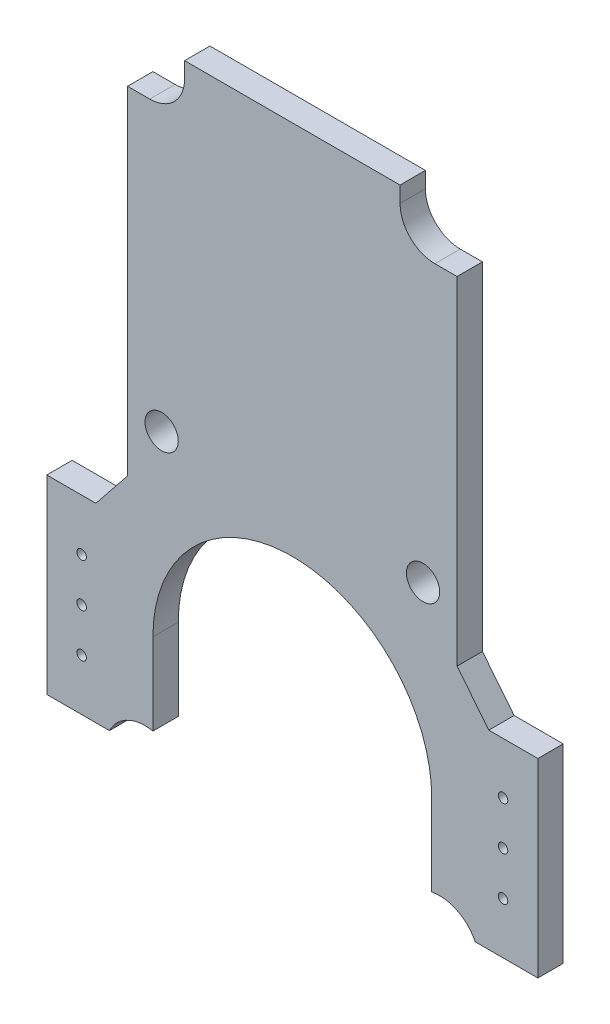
ISO-10303-21;
HEADER;
FILE_DESCRIPTION(('STEP AP214'),'2;1');
FILE_NAME('part.step','',(''),(''),'','','');
FILE_SCHEMA(('AUTOMOTIVE_DESIGN { 1 0 10303 214 1 1 1 1 }'));
ENDSEC;
DATA;
#1=APPLICATION_CONTEXT('core data for automotive mechanical design processes');
#2=APPLICATION_PROTOCOL_DEFINITION('international standard','automotive_design',2000,#1);
#3=PRODUCT_CONTEXT('',#1,'mechanical');
#4=PRODUCT('Part','Part','',(#3));
#5=PRODUCT_RELATED_PRODUCT_CATEGORY('part','',(#4));
#6=PRODUCT_DEFINITION_FORMATION('','',#4);
#7=PRODUCT_DEFINITION_CONTEXT('part definition',#1,'design');
#8=PRODUCT_DEFINITION('design','',#6,#7);
#9=PRODUCT_DEFINITION_SHAPE('','',#8);
#10=(LENGTH_UNIT() NAMED_UNIT(*) SI_UNIT(.MILLI.,.METRE.));
#11=(NAMED_UNIT(*) PLANE_ANGLE_UNIT() SI_UNIT($,.RADIAN.));
#12=(NAMED_UNIT(*) SI_UNIT($,.STERADIAN.) SOLID_ANGLE_UNIT());
#13=UNCERTAINTY_MEASURE_WITH_UNIT(LENGTH_MEASURE(1.E-05),#10,'distance_accuracy_value','');
#14=(GEOMETRIC_REPRESENTATION_CONTEXT(3) GLOBAL_UNCERTAINTY_ASSIGNED_CONTEXT((#13)) GLOBAL_UNIT_ASSIGNED_CONTEXT((#10,
#11,#12)) REPRESENTATION_CONTEXT('',''));
#15=CARTESIAN_POINT('',(0.,0.,0.));
#16=DIRECTION('',(0.,0.,1.));
#17=DIRECTION('',(1.,0.,0.));
#18=AXIS2_PLACEMENT_3D('',#15,#16,#17);
#19=CARTESIAN_POINT('',(13.3,-23.,0.));
#20=DIRECTION('',(0.,0.,1.));
#21=DIRECTION('',(1.,0.,0.));
#22=AXIS2_PLACEMENT_3D('',#19,#20,#21);
#23=CYLINDRICAL_SURFACE('',#22,0.299999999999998);
#24=CARTESIAN_POINT('',(13.3,-23.,1.6));
#25=DIRECTION('',(0.,0.,1.));
#26=DIRECTION('',(1.,0.,0.));
#27=AXIS2_PLACEMENT_3D('',#24,#25,#26);
#28=CIRCLE('',#27,0.299999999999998);
#29=CARTESIAN_POINT('',(13.6,-23.,1.6));
#30=VERTEX_POINT('',#29);
#31=EDGE_CURVE('E314',#30,#30,#28,.F.);
#32=ORIENTED_EDGE('',*,*,#31,.F.);
#33=EDGE_LOOP('',(#32));
#34=FACE_BOUND('',#33,.T.);
#35=CARTESIAN_POINT('',(13.3,-23.,0.));
#36=DIRECTION('',(0.,0.,1.));
#37=DIRECTION('',(1.,0.,0.));
#38=AXIS2_PLACEMENT_3D('',#35,#36,#37);
#39=CIRCLE('',#38,0.299999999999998);
#40=CARTESIAN_POINT('',(13.6,-23.,0.));
#41=VERTEX_POINT('',#40);
#42=EDGE_CURVE('E257',#41,#41,#39,.F.);
#43=ORIENTED_EDGE('',*,*,#42,.T.);
#44=EDGE_LOOP('',(#43));
#45=FACE_BOUND('',#44,.T.);
#46=ADVANCED_FACE('F17',(#34,#45),#23,.F.);
#47=CARTESIAN_POINT('',(13.3,-25.75,0.));
#48=DIRECTION('',(0.,0.,1.));
#49=DIRECTION('',(1.,0.,0.));
#50=AXIS2_PLACEMENT_3D('',#47,#48,#49);
#51=CYLINDRICAL_SURFACE('',#50,0.299999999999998);
#52=CARTESIAN_POINT('',(13.3,-25.75,1.6));
#53=DIRECTION('',(0.,0.,1.));
#54=DIRECTION('',(1.,0.,0.));
#55=AXIS2_PLACEMENT_3D('',#52,#53,#54);
#56=CIRCLE('',#55,0.299999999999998);
#57=CARTESIAN_POINT('',(13.6,-25.75,1.6));
#58=VERTEX_POINT('',#57);
#59=EDGE_CURVE('E311',#58,#58,#56,.F.);
#60=ORIENTED_EDGE('',*,*,#59,.F.);
#61=EDGE_LOOP('',(#60));
#62=FACE_BOUND('',#61,.T.);
#63=CARTESIAN_POINT('',(13.3,-25.75,0.));
#64=DIRECTION('',(0.,0.,1.));
#65=DIRECTION('',(1.,0.,0.));
#66=AXIS2_PLACEMENT_3D('',#63,#64,#65);
#67=CIRCLE('',#66,0.299999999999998);
#68=CARTESIAN_POINT('',(13.6,-25.75,0.));
#69=VERTEX_POINT('',#68);
#70=EDGE_CURVE('E254',#69,#69,#67,.F.);
#71=ORIENTED_EDGE('',*,*,#70,.T.);
#72=EDGE_LOOP('',(#71));
#73=FACE_BOUND('',#72,.T.);
#74=ADVANCED_FACE('F633',(#62,#73),#51,.F.);
#75=CARTESIAN_POINT('',(-13.3,-25.75,0.));
#76=DIRECTION('',(0.,0.,1.));
#77=DIRECTION('',(1.,0.,0.));
#78=AXIS2_PLACEMENT_3D('',#75,#76,#77);
#79=CYLINDRICAL_SURFACE('',#78,0.3);
#80=CARTESIAN_POINT('',(-13.3,-25.75,1.6));
#81=DIRECTION('',(0.,0.,1.));
#82=DIRECTION('',(1.,0.,0.));
#83=AXIS2_PLACEMENT_3D('',#80,#81,#82);
#84=CIRCLE('',#83,0.3);
#85=CARTESIAN_POINT('',(-13.,-25.75,1.6));
#86=VERTEX_POINT('',#85);
#87=EDGE_CURVE('E308',#86,#86,#84,.F.);
#88=ORIENTED_EDGE('',*,*,#87,.F.);
#89=EDGE_LOOP('',(#88));
#90=FACE_BOUND('',#89,.T.);
#91=CARTESIAN_POINT('',(-13.3,-25.75,0.));
#92=DIRECTION('',(0.,0.,1.));
#93=DIRECTION('',(1.,0.,0.));
#94=AXIS2_PLACEMENT_3D('',#91,#92,#93);
#95=CIRCLE('',#94,0.3);
#96=CARTESIAN_POINT('',(-13.,-25.75,0.));
#97=VERTEX_POINT('',#96);
#98=EDGE_CURVE('E251',#97,#97,#95,.F.);
#99=ORIENTED_EDGE('',*,*,#98,.T.);
#100=EDGE_LOOP('',(#99));
#101=FACE_BOUND('',#100,.T.);
#102=ADVANCED_FACE('F639',(#90,#101),#79,.F.);
#103=CARTESIAN_POINT('',(-13.3,-23.,0.));
#104=DIRECTION('',(0.,0.,1.));
#105=DIRECTION('',(1.,0.,0.));
#106=AXIS2_PLACEMENT_3D('',#103,#104,#105);
#107=CYLINDRICAL_SURFACE('',#106,0.3);
#108=CARTESIAN_POINT('',(-13.3,-23.,1.6));
#109=DIRECTION('',(0.,0.,1.));
#110=DIRECTION('',(1.,0.,0.));
#111=AXIS2_PLACEMENT_3D('',#108,#109,#110);
#112=CIRCLE('',#111,0.3);
#113=CARTESIAN_POINT('',(-13.,-23.,1.6));
#114=VERTEX_POINT('',#113);
#115=EDGE_CURVE('E305',#114,#114,#112,.F.);
#116=ORIENTED_EDGE('',*,*,#115,.F.);
#117=EDGE_LOOP('',(#116));
#118=FACE_BOUND('',#117,.T.);
#119=CARTESIAN_POINT('',(-13.3,-23.,0.));
#120=DIRECTION('',(0.,0.,1.));
#121=DIRECTION('',(1.,0.,0.));
#122=AXIS2_PLACEMENT_3D('',#119,#120,#121);
#123=CIRCLE('',#122,0.3);
#124=CARTESIAN_POINT('',(-13.,-23.,0.));
#125=VERTEX_POINT('',#124);
#126=EDGE_CURVE('E248',#125,#125,#123,.F.);
#127=ORIENTED_EDGE('',*,*,#126,.T.);
#128=EDGE_LOOP('',(#127));
#129=FACE_BOUND('',#128,.T.);
#130=ADVANCED_FACE('F644',(#118,#129),#107,.F.);
#131=CARTESIAN_POINT('',(-13.3,-20.25,0.));
#132=DIRECTION('',(0.,0.,1.));
#133=DIRECTION('',(1.,0.,0.));
#134=AXIS2_PLACEMENT_3D('',#131,#132,#133);
#135=CYLINDRICAL_SURFACE('',#134,0.3);
#136=CARTESIAN_POINT('',(-13.3,-20.25,1.6));
#137=DIRECTION('',(0.,0.,1.));
#138=DIRECTION('',(1.,0.,0.));
#139=AXIS2_PLACEMENT_3D('',#136,#137,#138);
#140=CIRCLE('',#139,0.3);
#141=CARTESIAN_POINT('',(-13.,-20.25,1.6));
#142=VERTEX_POINT('',#141);
#143=EDGE_CURVE('E133',#142,#142,#140,.F.);
#144=ORIENTED_EDGE('',*,*,#143,.F.);
#145=EDGE_LOOP('',(#144));
#146=FACE_BOUND('',#145,.T.);
#147=CARTESIAN_POINT('',(-13.3,-20.25,0.));
#148=DIRECTION('',(0.,0.,1.));
#149=DIRECTION('',(1.,0.,0.));
#150=AXIS2_PLACEMENT_3D('',#147,#148,#149);
#151=CIRCLE('',#150,0.3);
#152=CARTESIAN_POINT('',(-13.,-20.25,0.));
#153=VERTEX_POINT('',#152);
#154=EDGE_CURVE('E21',#153,#153,#151,.F.);
#155=ORIENTED_EDGE('',*,*,#154,.T.);
#156=EDGE_LOOP('',(#155));
#157=FACE_BOUND('',#156,.T.);
#158=ADVANCED_FACE('F323',(#146,#157),#135,.F.);
#159=CARTESIAN_POINT('',(-15.5,-29.,1.6));
#160=DIRECTION('',(0.,0.,1.));
#161=DIRECTION('',(1.,0.,0.));
#162=AXIS2_PLACEMENT_3D('',#159,#160,#161);
#163=PLANE('',#162);
#164=CARTESIAN_POINT('',(8.25,-11.,1.6));
#165=DIRECTION('',(0.,0.,1.));
#166=DIRECTION('',(1.,0.,0.));
#167=AXIS2_PLACEMENT_3D('',#164,#165,#166);
#168=CIRCLE('',#167,1.05);
#169=CARTESIAN_POINT('',(9.3,-11.,1.6));
#170=VERTEX_POINT('',#169);
#171=EDGE_CURVE('E291',#170,#170,#168,.T.);
#172=ORIENTED_EDGE('',*,*,#171,.F.);
#173=EDGE_LOOP('',(#172));
#174=FACE_BOUND('',#173,.T.);
#175=CARTESIAN_POINT('',(-8.25,-11.,1.6));
#176=DIRECTION('',(0.,0.,1.));
#177=DIRECTION('',(1.,0.,0.));
#178=AXIS2_PLACEMENT_3D('',#175,#176,#177);
#179=CIRCLE('',#178,1.05);
#180=CARTESIAN_POINT('',(-7.2,-11.,1.6));
#181=VERTEX_POINT('',#180);
#182=EDGE_CURVE('E150',#181,#181,#179,.T.);
#183=ORIENTED_EDGE('',*,*,#182,.F.);
#184=EDGE_LOOP('',(#183));
#185=FACE_BOUND('',#184,.T.);
#186=ORIENTED_EDGE('',*,*,#143,.T.);
#187=EDGE_LOOP('',(#186));
#188=FACE_BOUND('',#187,.T.);
#189=ORIENTED_EDGE('',*,*,#115,.T.);
#190=EDGE_LOOP('',(#189));
#191=FACE_BOUND('',#190,.T.);
#192=ORIENTED_EDGE('',*,*,#87,.T.);
#193=EDGE_LOOP('',(#192));
#194=FACE_BOUND('',#193,.T.);
#195=ORIENTED_EDGE('',*,*,#59,.T.);
#196=EDGE_LOOP('',(#195));
#197=FACE_BOUND('',#196,.T.);
#198=ORIENTED_EDGE('',*,*,#31,.T.);
#199=EDGE_LOOP('',(#198));
#200=FACE_BOUND('',#199,.T.);
#201=CARTESIAN_POINT('',(13.3,-20.25,1.6));
#202=DIRECTION('',(0.,0.,1.));
#203=DIRECTION('',(1.,0.,0.));
#204=AXIS2_PLACEMENT_3D('',#201,#202,#203);
#205=CIRCLE('',#204,0.299999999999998);
#206=CARTESIAN_POINT('',(13.6,-20.25,1.6));
#207=VERTEX_POINT('',#206);
#208=EDGE_CURVE('E316',#207,#207,#205,.F.);
#209=ORIENTED_EDGE('',*,*,#208,.T.);
#210=EDGE_LOOP('',(#209));
#211=FACE_BOUND('',#210,.T.);
#212=DIRECTION('',(0.,-1.,0.));
#213=VECTOR('',#212,1.);
#214=CARTESIAN_POINT('',(-15.5,-23.,1.6));
#215=LINE('',#214,#213);
#216=CARTESIAN_POINT('',(-15.5,-17.,1.6));
#217=VERTEX_POINT('',#216);
#218=CARTESIAN_POINT('',(-15.5,-29.,1.6));
#219=VERTEX_POINT('',#218);
#220=EDGE_CURVE('E158',#217,#219,#215,.T.);
#221=ORIENTED_EDGE('',*,*,#220,.T.);
#222=DIRECTION('',(1.,0.,0.));
#223=VECTOR('',#222,1.);
#224=CARTESIAN_POINT('',(-13.522497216,-29.,1.6));
#225=LINE('',#224,#223);
#226=CARTESIAN_POINT('',(-11.5449944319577,-28.9999999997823,1.6));
#227=VERTEX_POINT('',#226);
#228=EDGE_CURVE('E151',#219,#227,#225,.T.);
#229=ORIENTED_EDGE('',*,*,#228,.T.);
#230=CARTESIAN_POINT('',(-9.3,-30.1,1.6));
#231=DIRECTION('',(0.,0.,1.));
#232=DIRECTION('',(1.,0.,0.));
#233=AXIS2_PLACEMENT_3D('',#230,#231,#232);
#234=CIRCLE('',#233,2.5);
#235=CARTESIAN_POINT('',(-8.8,-27.6505102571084,1.6));
#236=VERTEX_POINT('',#235);
#237=EDGE_CURVE('E154',#236,#227,#234,.T.);
#238=ORIENTED_EDGE('',*,*,#237,.F.);
#239=DIRECTION('',(0.,1.,0.));
#240=VECTOR('',#239,1.);
#241=CARTESIAN_POINT('',(-8.8,-25.0752551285,1.6));
#242=LINE('',#241,#240);
#243=CARTESIAN_POINT('',(-8.8,-22.5,1.6));
#244=VERTEX_POINT('',#243);
#245=EDGE_CURVE('E127',#236,#244,#242,.T.);
#246=ORIENTED_EDGE('',*,*,#245,.T.);
#247=CARTESIAN_POINT('',(0.,-22.5,1.6));
#248=DIRECTION('',(0.,0.,1.));
#249=DIRECTION('',(1.,0.,0.));
#250=AXIS2_PLACEMENT_3D('',#247,#248,#249);
#251=CIRCLE('',#250,8.8);
#252=CARTESIAN_POINT('',(8.8,-22.5,1.6));
#253=VERTEX_POINT('',#252);
#254=EDGE_CURVE('E121',#253,#244,#251,.T.);
#255=ORIENTED_EDGE('',*,*,#254,.F.);
#256=DIRECTION('',(0.,-1.,0.));
#257=VECTOR('',#256,1.);
#258=CARTESIAN_POINT('',(8.8,-25.0752551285,1.6));
#259=LINE('',#258,#257);
#260=CARTESIAN_POINT('',(8.79999999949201,-27.6505102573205,1.6));
#261=VERTEX_POINT('',#260);
#262=EDGE_CURVE('E125',#253,#261,#259,.T.);
#263=ORIENTED_EDGE('',*,*,#262,.T.);
#264=CARTESIAN_POINT('',(9.3,-30.1,1.6));
#265=DIRECTION('',(0.,0.,1.));
#266=DIRECTION('',(1.,0.,0.));
#267=AXIS2_PLACEMENT_3D('',#264,#265,#266);
#268=CIRCLE('',#267,2.5);
#269=CARTESIAN_POINT('',(11.5449944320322,-29.,1.6));
#270=VERTEX_POINT('',#269);
#271=EDGE_CURVE('E140',#270,#261,#268,.T.);
#272=ORIENTED_EDGE('',*,*,#271,.F.);
#273=DIRECTION('',(1.,0.,0.));
#274=VECTOR('',#273,1.);
#275=CARTESIAN_POINT('',(13.522497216,-29.,1.6));
#276=LINE('',#275,#274);
#277=CARTESIAN_POINT('',(15.5,-29.,1.6));
#278=VERTEX_POINT('',#277);
#279=EDGE_CURVE('E237',#270,#278,#276,.T.);
#280=ORIENTED_EDGE('',*,*,#279,.T.);
#281=DIRECTION('',(0.,1.,0.));
#282=VECTOR('',#281,1.);
#283=CARTESIAN_POINT('',(15.5,-23.,1.6));
#284=LINE('',#283,#282);
#285=CARTESIAN_POINT('',(15.5,-17.,1.6));
#286=VERTEX_POINT('',#285);
#287=EDGE_CURVE('E231',#278,#286,#284,.T.);
#288=ORIENTED_EDGE('',*,*,#287,.T.);
#289=DIRECTION('',(-1.,0.,0.));
#290=VECTOR('',#289,1.);
#291=CARTESIAN_POINT('',(13.95,-17.,1.6));
#292=LINE('',#291,#290);
#293=CARTESIAN_POINT('',(12.4,-17.,1.6));
#294=VERTEX_POINT('',#293);
#295=EDGE_CURVE('E225',#286,#294,#292,.T.);
#296=ORIENTED_EDGE('',*,*,#295,.T.);
#297=DIRECTION('',(-0.624695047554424,0.78086880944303,0.));
#298=VECTOR('',#297,1.);
#299=CARTESIAN_POINT('',(11.4,-15.75,1.6));
#300=LINE('',#299,#298);
#301=CARTESIAN_POINT('',(10.4,-14.5,1.6));
#302=VERTEX_POINT('',#301);
#303=EDGE_CURVE('E219',#294,#302,#300,.T.);
#304=ORIENTED_EDGE('',*,*,#303,.T.);
#305=DIRECTION('',(0.,1.,0.));
#306=VECTOR('',#305,1.);
#307=CARTESIAN_POINT('',(10.4,-3.85,1.6));
#308=LINE('',#307,#306);
#309=CARTESIAN_POINT('',(10.4,6.8,1.6));
#310=VERTEX_POINT('',#309);
#311=EDGE_CURVE('E213',#302,#310,#308,.T.);
#312=ORIENTED_EDGE('',*,*,#311,.T.);
#313=DIRECTION('',(-1.,0.,0.));
#314=VECTOR('',#313,1.);
#315=CARTESIAN_POINT('',(9.7,6.8,1.6));
#316=LINE('',#315,#314);
#317=CARTESIAN_POINT('',(8.99999999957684,6.8,1.6));
#318=VERTEX_POINT('',#317);
#319=EDGE_CURVE('E206',#310,#318,#316,.T.);
#320=ORIENTED_EDGE('',*,*,#319,.T.);
#321=CARTESIAN_POINT('',(9.,9.,1.6));
#322=DIRECTION('',(0.,0.,1.));
#323=DIRECTION('',(1.,0.,0.));
#324=AXIS2_PLACEMENT_3D('',#321,#322,#323);
#325=CIRCLE('',#324,2.2);
#326=CARTESIAN_POINT('',(6.8,9.,1.6));
#327=VERTEX_POINT('',#326);
#328=EDGE_CURVE('E209',#327,#318,#325,.T.);
#329=ORIENTED_EDGE('',*,*,#328,.F.);
#330=DIRECTION('',(0.,1.,0.));
#331=VECTOR('',#330,1.);
#332=CARTESIAN_POINT('',(6.8,9.5,1.6));
#333=LINE('',#332,#331);
#334=CARTESIAN_POINT('',(6.8,10.,1.6));
#335=VERTEX_POINT('',#334);
#336=EDGE_CURVE('E200',#327,#335,#333,.T.);
#337=ORIENTED_EDGE('',*,*,#336,.T.);
#338=DIRECTION('',(-1.,0.,0.));
#339=VECTOR('',#338,1.);
#340=CARTESIAN_POINT('',(0.,10.,1.6));
#341=LINE('',#340,#339);
#342=CARTESIAN_POINT('',(-6.8,10.,1.6));
#343=VERTEX_POINT('',#342);
#344=EDGE_CURVE('E194',#335,#343,#341,.T.);
#345=ORIENTED_EDGE('',*,*,#344,.T.);
#346=DIRECTION('',(0.,-1.,0.));
#347=VECTOR('',#346,1.);
#348=CARTESIAN_POINT('',(-6.8,9.5,1.6));
#349=LINE('',#348,#347);
#350=CARTESIAN_POINT('',(-6.8,8.99999999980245,1.6));
#351=VERTEX_POINT('',#350);
#352=EDGE_CURVE('E187',#343,#351,#349,.T.);
#353=ORIENTED_EDGE('',*,*,#352,.T.);
#354=CARTESIAN_POINT('',(-9.,9.,1.6));
#355=DIRECTION('',(0.,0.,1.));
#356=DIRECTION('',(1.,0.,0.));
#357=AXIS2_PLACEMENT_3D('',#354,#355,#356);
#358=CIRCLE('',#357,2.2);
#359=CARTESIAN_POINT('',(-9.,6.8,1.6));
#360=VERTEX_POINT('',#359);
#361=EDGE_CURVE('E190',#360,#351,#358,.T.);
#362=ORIENTED_EDGE('',*,*,#361,.F.);
#363=DIRECTION('',(-1.,0.,0.));
#364=VECTOR('',#363,1.);
#365=CARTESIAN_POINT('',(-9.7,6.8,1.6));
#366=LINE('',#365,#364);
#367=CARTESIAN_POINT('',(-10.4,6.8,1.6));
#368=VERTEX_POINT('',#367);
#369=EDGE_CURVE('E181',#360,#368,#366,.T.);
#370=ORIENTED_EDGE('',*,*,#369,.T.);
#371=DIRECTION('',(0.,-1.,0.));
#372=VECTOR('',#371,1.);
#373=CARTESIAN_POINT('',(-10.4,-3.85,1.6));
#374=LINE('',#373,#372);
#375=CARTESIAN_POINT('',(-10.4,-14.5,1.6));
#376=VERTEX_POINT('',#375);
#377=EDGE_CURVE('E175',#368,#376,#374,.T.);
#378=ORIENTED_EDGE('',*,*,#377,.T.);
#379=DIRECTION('',(-0.624695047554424,-0.78086880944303,0.));
#380=VECTOR('',#379,1.);
#381=CARTESIAN_POINT('',(-11.4,-15.75,1.6));
#382=LINE('',#381,#380);
#383=CARTESIAN_POINT('',(-12.4,-17.,1.6));
#384=VERTEX_POINT('',#383);
#385=EDGE_CURVE('E169',#376,#384,#382,.T.);
#386=ORIENTED_EDGE('',*,*,#385,.T.);
#387=DIRECTION('',(-1.,0.,0.));
#388=VECTOR('',#387,1.);
#389=CARTESIAN_POINT('',(-13.95,-17.,1.6));
#390=LINE('',#389,#388);
#391=EDGE_CURVE('E163',#384,#217,#390,.T.);
#392=ORIENTED_EDGE('',*,*,#391,.T.);
#393=EDGE_LOOP('',(#221,#229,#238,#246,#255,#263,#272,#280,#288,#296,#304,#312,#320,#329,#337,
#345,#353,#362,#370,#378,#386,#392));
#394=FACE_BOUND('',#393,.T.);
#395=ADVANCED_FACE('F124',(#174,#185,#188,#191,#194,#197,#200,#211,#394),#163,.T.);
#396=CARTESIAN_POINT('',(0.,-22.5,0.));
#397=DIRECTION('',(0.,0.,1.));
#398=DIRECTION('',(1.,0.,0.));
#399=AXIS2_PLACEMENT_3D('',#396,#397,#398);
#400=CYLINDRICAL_SURFACE('',#399,8.8);
#401=CARTESIAN_POINT('',(0.,-22.5,0.));
#402=DIRECTION('',(0.,0.,1.));
#403=DIRECTION('',(1.,0.,0.));
#404=AXIS2_PLACEMENT_3D('',#401,#402,#403);
#405=CIRCLE('',#404,8.8);
#406=CARTESIAN_POINT('',(-8.800000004,-22.5,0.));
#407=VERTEX_POINT('',#406);
#408=CARTESIAN_POINT('',(8.800000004,-22.5,0.));
#409=VERTEX_POINT('',#408);
#410=EDGE_CURVE('E144',#407,#409,#405,.F.);
#411=ORIENTED_EDGE('',*,*,#410,.T.);
#412=DIRECTION('',(0.,0.,1.));
#413=VECTOR('',#412,1.);
#414=CARTESIAN_POINT('',(8.8,-22.5,0.8));
#415=LINE('',#414,#413);
#416=EDGE_CURVE('E132',#409,#253,#415,.T.);
#417=ORIENTED_EDGE('',*,*,#416,.T.);
#418=ORIENTED_EDGE('',*,*,#254,.T.);
#419=DIRECTION('',(0.,0.,-1.));
#420=VECTOR('',#419,1.);
#421=CARTESIAN_POINT('',(-8.8,-22.5,0.8));
#422=LINE('',#421,#420);
#423=EDGE_CURVE('E383',#244,#407,#422,.T.);
#424=ORIENTED_EDGE('',*,*,#423,.T.);
#425=EDGE_LOOP('',(#411,#417,#418,#424));
#426=FACE_BOUND('',#425,.T.);
#427=ADVANCED_FACE('F143',(#426),#400,.F.);
#428=CARTESIAN_POINT('',(8.8,-27.650510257,1.6));
#429=DIRECTION('',(1.,0.,0.));
#430=DIRECTION('',(0.,0.,-1.));
#431=AXIS2_PLACEMENT_3D('',#428,#429,#430);
#432=PLANE('',#431);
#433=DIRECTION('',(0.,0.,1.));
#434=VECTOR('',#433,1.);
#435=CARTESIAN_POINT('',(8.79999999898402,-27.6505102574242,0.8));
#436=LINE('',#435,#434);
#437=CARTESIAN_POINT('',(8.80000000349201,-27.650510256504,0.));
#438=VERTEX_POINT('',#437);
#439=EDGE_CURVE('E139',#261,#438,#436,.F.);
#440=ORIENTED_EDGE('',*,*,#439,.F.);
#441=ORIENTED_EDGE('',*,*,#262,.F.);
#442=ORIENTED_EDGE('',*,*,#416,.F.);
#443=DIRECTION('',(0.,-1.,0.));
#444=VECTOR('',#443,1.);
#445=CARTESIAN_POINT('',(8.800000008,-9.5,0.));
#446=LINE('',#445,#444);
#447=EDGE_CURVE('E289',#409,#438,#446,.T.);
#448=ORIENTED_EDGE('',*,*,#447,.T.);
#449=EDGE_LOOP('',(#440,#441,#442,#448));
#450=FACE_BOUND('',#449,.T.);
#451=ADVANCED_FACE('F136',(#450),#432,.F.);
#452=CARTESIAN_POINT('',(9.3,-30.1,0.));
#453=DIRECTION('',(0.,0.,1.));
#454=DIRECTION('',(1.,0.,0.));
#455=AXIS2_PLACEMENT_3D('',#452,#453,#454);
#456=CYLINDRICAL_SURFACE('',#455,2.5);
#457=CARTESIAN_POINT('',(9.3,-30.1,0.));
#458=DIRECTION('',(0.,0.,1.));
#459=DIRECTION('',(1.,0.,0.));
#460=AXIS2_PLACEMENT_3D('',#457,#458,#459);
#461=CIRCLE('',#460,2.5);
#462=CARTESIAN_POINT('',(11.5449944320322,-29.,0.));
#463=VERTEX_POINT('',#462);
#464=EDGE_CURVE('E285',#438,#463,#461,.F.);
#465=ORIENTED_EDGE('',*,*,#464,.T.);
#466=DIRECTION('',(0.,0.,1.));
#467=VECTOR('',#466,1.);
#468=CARTESIAN_POINT('',(11.544994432,-29.,0.8));
#469=LINE('',#468,#467);
#470=EDGE_CURVE('E240',#463,#270,#469,.T.);
#471=ORIENTED_EDGE('',*,*,#470,.T.);
#472=ORIENTED_EDGE('',*,*,#271,.T.);
#473=ORIENTED_EDGE('',*,*,#439,.T.);
#474=EDGE_LOOP('',(#465,#471,#472,#473));
#475=FACE_BOUND('',#474,.T.);
#476=ADVANCED_FACE('F467',(#475),#456,.F.);
#477=CARTESIAN_POINT('',(15.5,-29.,0.));
#478=DIRECTION('',(0.,1.,0.));
#479=DIRECTION('',(-1.,0.,0.));
#480=AXIS2_PLACEMENT_3D('',#477,#478,#479);
#481=PLANE('',#480);
#482=ORIENTED_EDGE('',*,*,#470,.F.);
#483=DIRECTION('',(1.,0.,0.));
#484=VECTOR('',#483,1.);
#485=CARTESIAN_POINT('',(0.,-29.,0.));
#486=LINE('',#485,#484);
#487=CARTESIAN_POINT('',(15.5,-29.,0.));
#488=VERTEX_POINT('',#487);
#489=EDGE_CURVE('E288',#463,#488,#486,.T.);
#490=ORIENTED_EDGE('',*,*,#489,.T.);
#491=DIRECTION('',(0.,0.,1.));
#492=VECTOR('',#491,1.);
#493=CARTESIAN_POINT('',(15.5,-29.,0.8));
#494=LINE('',#493,#492);
#495=EDGE_CURVE('E234',#488,#278,#494,.T.);
#496=ORIENTED_EDGE('',*,*,#495,.T.);
#497=ORIENTED_EDGE('',*,*,#279,.F.);
#498=EDGE_LOOP('',(#482,#490,#496,#497));
#499=FACE_BOUND('',#498,.T.);
#500=ADVANCED_FACE('F472',(#499),#481,.F.);
#501=CARTESIAN_POINT('',(15.5,-29.,0.));
#502=DIRECTION('',(-1.,0.,0.));
#503=DIRECTION('',(0.,0.,1.));
#504=AXIS2_PLACEMENT_3D('',#501,#502,#503);
#505=PLANE('',#504);
#506=DIRECTION('',(0.,0.,1.));
#507=VECTOR('',#506,1.);
#508=CARTESIAN_POINT('',(15.5,-17.,0.8));
#509=LINE('',#508,#507);
#510=CARTESIAN_POINT('',(15.5,-16.999999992,0.));
#511=VERTEX_POINT('',#510);
#512=EDGE_CURVE('E228',#511,#286,#509,.T.);
#513=ORIENTED_EDGE('',*,*,#512,.T.);
#514=ORIENTED_EDGE('',*,*,#287,.F.);
#515=ORIENTED_EDGE('',*,*,#495,.F.);
#516=DIRECTION('',(0.,1.,0.));
#517=VECTOR('',#516,1.);
#518=CARTESIAN_POINT('',(15.5,-9.5,0.));
#519=LINE('',#518,#517);
#520=EDGE_CURVE('E378',#488,#511,#519,.T.);
#521=ORIENTED_EDGE('',*,*,#520,.T.);
#522=EDGE_LOOP('',(#513,#514,#515,#521));
#523=FACE_BOUND('',#522,.T.);
#524=ADVANCED_FACE('F562',(#523),#505,.F.);
#525=CARTESIAN_POINT('',(12.4,-17.,0.));
#526=DIRECTION('',(0.,-1.,0.));
#527=DIRECTION('',(1.,0.,0.));
#528=AXIS2_PLACEMENT_3D('',#525,#526,#527);
#529=PLANE('',#528);
#530=DIRECTION('',(0.,0.,1.));
#531=VECTOR('',#530,1.);
#532=CARTESIAN_POINT('',(12.4,-17.,0.8));
#533=LINE('',#532,#531);
#534=CARTESIAN_POINT('',(12.3999999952,-16.999999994,0.));
#535=VERTEX_POINT('',#534);
#536=EDGE_CURVE('E222',#535,#294,#533,.T.);
#537=ORIENTED_EDGE('',*,*,#536,.T.);
#538=ORIENTED_EDGE('',*,*,#295,.F.);
#539=ORIENTED_EDGE('',*,*,#512,.F.);
#540=DIRECTION('',(-1.,0.,0.));
#541=VECTOR('',#540,1.);
#542=CARTESIAN_POINT('',(0.,-16.999999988,0.));
#543=LINE('',#542,#541);
#544=EDGE_CURVE('E284',#511,#535,#543,.T.);
#545=ORIENTED_EDGE('',*,*,#544,.T.);
#546=EDGE_LOOP('',(#537,#538,#539,#545));
#547=FACE_BOUND('',#546,.T.);
#548=ADVANCED_FACE('F561',(#547),#529,.F.);
#549=CARTESIAN_POINT('',(10.4,-14.5,0.));
#550=DIRECTION('',(-0.78086880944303,-0.624695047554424,0.));
#551=DIRECTION('',(0.624695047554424,-0.78086880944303,0.));
#552=AXIS2_PLACEMENT_3D('',#549,#550,#551);
#553=PLANE('',#552);
#554=DIRECTION('',(0.,0.,1.));
#555=VECTOR('',#554,1.);
#556=CARTESIAN_POINT('',(10.4,-14.5,0.8));
#557=LINE('',#556,#555);
#558=CARTESIAN_POINT('',(10.4000000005,-14.500000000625,0.));
#559=VERTEX_POINT('',#558);
#560=EDGE_CURVE('E216',#559,#302,#557,.T.);
#561=ORIENTED_EDGE('',*,*,#560,.T.);
#562=ORIENTED_EDGE('',*,*,#303,.F.);
#563=ORIENTED_EDGE('',*,*,#536,.F.);
#564=DIRECTION('',(0.624695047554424,-0.78086880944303,0.));
#565=VECTOR('',#564,1.);
#566=CARTESIAN_POINT('',(10.4,-14.5,0.));
#567=LINE('',#566,#565);
#568=EDGE_CURVE('E280',#535,#559,#567,.F.);
#569=ORIENTED_EDGE('',*,*,#568,.T.);
#570=EDGE_LOOP('',(#561,#562,#563,#569));
#571=FACE_BOUND('',#570,.T.);
#572=ADVANCED_FACE('F559',(#571),#553,.F.);
#573=CARTESIAN_POINT('',(10.4,6.8,0.));
#574=DIRECTION('',(-1.,0.,0.));
#575=DIRECTION('',(0.,-1.,0.));
#576=AXIS2_PLACEMENT_3D('',#573,#574,#575);
#577=PLANE('',#576);
#578=DIRECTION('',(0.,0.,1.));
#579=VECTOR('',#578,1.);
#580=CARTESIAN_POINT('',(10.4,6.8,0.8));
#581=LINE('',#580,#579);
#582=CARTESIAN_POINT('',(10.4000000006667,6.80000000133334,0.));
#583=VERTEX_POINT('',#582);
#584=EDGE_CURVE('E210',#583,#310,#581,.T.);
#585=ORIENTED_EDGE('',*,*,#584,.T.);
#586=ORIENTED_EDGE('',*,*,#311,.F.);
#587=ORIENTED_EDGE('',*,*,#560,.F.);
#588=DIRECTION('',(0.,1.,0.));
#589=VECTOR('',#588,1.);
#590=CARTESIAN_POINT('',(10.400000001,-9.5,0.));
#591=LINE('',#590,#589);
#592=EDGE_CURVE('E283',#559,#583,#591,.T.);
#593=ORIENTED_EDGE('',*,*,#592,.T.);
#594=EDGE_LOOP('',(#585,#586,#587,#593));
#595=FACE_BOUND('',#594,.T.);
#596=ADVANCED_FACE('F556',(#595),#577,.F.);
#597=CARTESIAN_POINT('',(9.,6.8,1.6));
#598=DIRECTION('',(0.,-1.,0.));
#599=DIRECTION('',(0.,0.,-1.));
#600=AXIS2_PLACEMENT_3D('',#597,#598,#599);
#601=PLANE('',#600);
#602=ORIENTED_EDGE('',*,*,#584,.F.);
#603=DIRECTION('',(-1.,0.,0.));
#604=VECTOR('',#603,1.);
#605=CARTESIAN_POINT('',(0.,6.800000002,0.));
#606=LINE('',#605,#604);
#607=CARTESIAN_POINT('',(8.99999999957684,6.800000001,0.));
#608=VERTEX_POINT('',#607);
#609=EDGE_CURVE('E279',#583,#608,#606,.T.);
#610=ORIENTED_EDGE('',*,*,#609,.T.);
#611=DIRECTION('',(0.,0.,1.));
#612=VECTOR('',#611,1.);
#613=CARTESIAN_POINT('',(8.99999999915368,6.8,0.8));
#614=LINE('',#613,#612);
#615=EDGE_CURVE('E301',#318,#608,#614,.F.);
#616=ORIENTED_EDGE('',*,*,#615,.F.);
#617=ORIENTED_EDGE('',*,*,#319,.F.);
#618=EDGE_LOOP('',(#602,#610,#616,#617));
#619=FACE_BOUND('',#618,.T.);
#620=ADVANCED_FACE('F552',(#619),#601,.F.);
#621=CARTESIAN_POINT('',(9.,9.,0.));
#622=DIRECTION('',(0.,0.,1.));
#623=DIRECTION('',(1.,0.,0.));
#624=AXIS2_PLACEMENT_3D('',#621,#622,#623);
#625=CYLINDRICAL_SURFACE('',#624,2.2);
#626=CARTESIAN_POINT('',(9.,9.,0.));
#627=DIRECTION('',(0.,0.,1.));
#628=DIRECTION('',(1.,0.,0.));
#629=AXIS2_PLACEMENT_3D('',#626,#627,#628);
#630=CIRCLE('',#629,2.2);
#631=CARTESIAN_POINT('',(6.8000000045,9.,0.));
#632=VERTEX_POINT('',#631);
#633=EDGE_CURVE('E275',#608,#632,#630,.F.);
#634=ORIENTED_EDGE('',*,*,#633,.T.);
#635=DIRECTION('',(0.,0.,1.));
#636=VECTOR('',#635,1.);
#637=CARTESIAN_POINT('',(6.8,9.,0.8));
#638=LINE('',#637,#636);
#639=EDGE_CURVE('E203',#632,#327,#638,.T.);
#640=ORIENTED_EDGE('',*,*,#639,.T.);
#641=ORIENTED_EDGE('',*,*,#328,.T.);
#642=ORIENTED_EDGE('',*,*,#615,.T.);
#643=EDGE_LOOP('',(#634,#640,#641,#642));
#644=FACE_BOUND('',#643,.T.);
#645=ADVANCED_FACE('F548',(#644),#625,.F.);
#646=CARTESIAN_POINT('',(6.8,10.,0.));
#647=DIRECTION('',(-1.,0.,0.));
#648=DIRECTION('',(0.,-1.,0.));
#649=AXIS2_PLACEMENT_3D('',#646,#647,#648);
#650=PLANE('',#649);
#651=ORIENTED_EDGE('',*,*,#639,.F.);
#652=DIRECTION('',(0.,1.,0.));
#653=VECTOR('',#652,1.);
#654=CARTESIAN_POINT('',(6.800000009,-9.5,0.));
#655=LINE('',#654,#653);
#656=CARTESIAN_POINT('',(6.800000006,10.,0.));
#657=VERTEX_POINT('',#656);
#658=EDGE_CURVE('E278',#632,#657,#655,.T.);
#659=ORIENTED_EDGE('',*,*,#658,.T.);
#660=DIRECTION('',(0.,0.,1.));
#661=VECTOR('',#660,1.);
#662=CARTESIAN_POINT('',(6.8,10.,0.8));
#663=LINE('',#662,#661);
#664=EDGE_CURVE('E197',#657,#335,#663,.T.);
#665=ORIENTED_EDGE('',*,*,#664,.T.);
#666=ORIENTED_EDGE('',*,*,#336,.F.);
#667=EDGE_LOOP('',(#651,#659,#665,#666));
#668=FACE_BOUND('',#667,.T.);
#669=ADVANCED_FACE('F544',(#668),#650,.F.);
#670=CARTESIAN_POINT('',(-6.8,10.,0.));
#671=DIRECTION('',(0.,-1.,0.));
#672=DIRECTION('',(1.,0.,0.));
#673=AXIS2_PLACEMENT_3D('',#670,#671,#672);
#674=PLANE('',#673);
#675=DIRECTION('',(0.,0.,1.));
#676=VECTOR('',#675,1.);
#677=CARTESIAN_POINT('',(-6.8,10.,0.8));
#678=LINE('',#677,#676);
#679=CARTESIAN_POINT('',(-6.800000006,10.,0.));
#680=VERTEX_POINT('',#679);
#681=EDGE_CURVE('E191',#680,#343,#678,.T.);
#682=ORIENTED_EDGE('',*,*,#681,.T.);
#683=ORIENTED_EDGE('',*,*,#344,.F.);
#684=ORIENTED_EDGE('',*,*,#664,.F.);
#685=DIRECTION('',(-1.,0.,0.));
#686=VECTOR('',#685,1.);
#687=CARTESIAN_POINT('',(0.,10.,0.));
#688=LINE('',#687,#686);
#689=EDGE_CURVE('E365',#657,#680,#688,.T.);
#690=ORIENTED_EDGE('',*,*,#689,.T.);
#691=EDGE_LOOP('',(#682,#683,#684,#690));
#692=FACE_BOUND('',#691,.T.);
#693=ADVANCED_FACE('F540',(#692),#674,.F.);
#694=CARTESIAN_POINT('',(-6.8,9.,0.));
#695=DIRECTION('',(1.,0.,0.));
#696=DIRECTION('',(0.,1.,0.));
#697=AXIS2_PLACEMENT_3D('',#694,#695,#696);
#698=PLANE('',#697);
#699=ORIENTED_EDGE('',*,*,#681,.F.);
#700=DIRECTION('',(0.,-1.,0.));
#701=VECTOR('',#700,1.);
#702=CARTESIAN_POINT('',(-6.800000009,-9.5,0.));
#703=LINE('',#702,#701);
#704=CARTESIAN_POINT('',(-6.8000000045,8.99999999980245,0.));
#705=VERTEX_POINT('',#704);
#706=EDGE_CURVE('E274',#680,#705,#703,.T.);
#707=ORIENTED_EDGE('',*,*,#706,.T.);
#708=DIRECTION('',(0.,0.,1.));
#709=VECTOR('',#708,1.);
#710=CARTESIAN_POINT('',(-6.8,8.99999999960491,0.8));
#711=LINE('',#710,#709);
#712=EDGE_CURVE('E299',#351,#705,#711,.F.);
#713=ORIENTED_EDGE('',*,*,#712,.F.);
#714=ORIENTED_EDGE('',*,*,#352,.F.);
#715=EDGE_LOOP('',(#699,#707,#713,#714));
#716=FACE_BOUND('',#715,.T.);
#717=ADVANCED_FACE('F536',(#716),#698,.F.);
#718=CARTESIAN_POINT('',(-9.,9.,0.));
#719=DIRECTION('',(0.,0.,1.));
#720=DIRECTION('',(1.,0.,0.));
#721=AXIS2_PLACEMENT_3D('',#718,#719,#720);
#722=CYLINDRICAL_SURFACE('',#721,2.2);
#723=CARTESIAN_POINT('',(-9.,9.,0.));
#724=DIRECTION('',(0.,0.,1.));
#725=DIRECTION('',(1.,0.,0.));
#726=AXIS2_PLACEMENT_3D('',#723,#724,#725);
#727=CIRCLE('',#726,2.2);
#728=CARTESIAN_POINT('',(-9.,6.800000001,0.));
#729=VERTEX_POINT('',#728);
#730=EDGE_CURVE('E270',#705,#729,#727,.F.);
#731=ORIENTED_EDGE('',*,*,#730,.T.);
#732=DIRECTION('',(0.,0.,1.));
#733=VECTOR('',#732,1.);
#734=CARTESIAN_POINT('',(-9.,6.8,0.8));
#735=LINE('',#734,#733);
#736=EDGE_CURVE('E184',#729,#360,#735,.T.);
#737=ORIENTED_EDGE('',*,*,#736,.T.);
#738=ORIENTED_EDGE('',*,*,#361,.T.);
#739=ORIENTED_EDGE('',*,*,#712,.T.);
#740=EDGE_LOOP('',(#731,#737,#738,#739));
#741=FACE_BOUND('',#740,.T.);
#742=ADVANCED_FACE('F532',(#741),#722,.F.);
#743=CARTESIAN_POINT('',(-10.4,6.8,0.));
#744=DIRECTION('',(0.,-1.,0.));
#745=DIRECTION('',(1.,0.,0.));
#746=AXIS2_PLACEMENT_3D('',#743,#744,#745);
#747=PLANE('',#746);
#748=ORIENTED_EDGE('',*,*,#736,.F.);
#749=DIRECTION('',(-1.,0.,0.));
#750=VECTOR('',#749,1.);
#751=CARTESIAN_POINT('',(0.,6.800000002,0.));
#752=LINE('',#751,#750);
#753=CARTESIAN_POINT('',(-10.4000000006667,6.80000000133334,0.));
#754=VERTEX_POINT('',#753);
#755=EDGE_CURVE('E273',#729,#754,#752,.T.);
#756=ORIENTED_EDGE('',*,*,#755,.T.);
#757=DIRECTION('',(0.,0.,1.));
#758=VECTOR('',#757,1.);
#759=CARTESIAN_POINT('',(-10.4,6.8,0.8));
#760=LINE('',#759,#758);
#761=EDGE_CURVE('E178',#754,#368,#760,.T.);
#762=ORIENTED_EDGE('',*,*,#761,.T.);
#763=ORIENTED_EDGE('',*,*,#369,.F.);
#764=EDGE_LOOP('',(#748,#756,#762,#763));
#765=FACE_BOUND('',#764,.T.);
#766=ADVANCED_FACE('F528',(#765),#747,.F.);
#767=CARTESIAN_POINT('',(-10.4,-14.5,1.6));
#768=DIRECTION('',(1.,0.,0.));
#769=DIRECTION('',(0.,0.,-1.));
#770=AXIS2_PLACEMENT_3D('',#767,#768,#769);
#771=PLANE('',#770);
#772=ORIENTED_EDGE('',*,*,#761,.F.);
#773=DIRECTION('',(0.,-1.,0.));
#774=VECTOR('',#773,1.);
#775=CARTESIAN_POINT('',(-10.400000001,-9.5,0.));
#776=LINE('',#775,#774);
#777=CARTESIAN_POINT('',(-10.4000000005,-14.500000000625,0.));
#778=VERTEX_POINT('',#777);
#779=EDGE_CURVE('E269',#754,#778,#776,.T.);
#780=ORIENTED_EDGE('',*,*,#779,.T.);
#781=DIRECTION('',(0.,0.,1.));
#782=VECTOR('',#781,1.);
#783=CARTESIAN_POINT('',(-10.4,-14.5,0.8));
#784=LINE('',#783,#782);
#785=EDGE_CURVE('E172',#778,#376,#784,.T.);
#786=ORIENTED_EDGE('',*,*,#785,.T.);
#787=ORIENTED_EDGE('',*,*,#377,.F.);
#788=EDGE_LOOP('',(#772,#780,#786,#787));
#789=FACE_BOUND('',#788,.T.);
#790=ADVANCED_FACE('F524',(#789),#771,.F.);
#791=CARTESIAN_POINT('',(-12.4,-17.,0.));
#792=DIRECTION('',(0.78086880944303,-0.624695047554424,0.));
#793=DIRECTION('',(0.624695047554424,0.78086880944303,0.));
#794=AXIS2_PLACEMENT_3D('',#791,#792,#793);
#795=PLANE('',#794);
#796=DIRECTION('',(0.,0.,1.));
#797=VECTOR('',#796,1.);
#798=CARTESIAN_POINT('',(-12.4,-17.,0.8));
#799=LINE('',#798,#797);
#800=CARTESIAN_POINT('',(-12.3999999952,-16.999999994,0.));
#801=VERTEX_POINT('',#800);
#802=EDGE_CURVE('E166',#801,#384,#799,.T.);
#803=ORIENTED_EDGE('',*,*,#802,.T.);
#804=ORIENTED_EDGE('',*,*,#385,.F.);
#805=ORIENTED_EDGE('',*,*,#785,.F.);
#806=DIRECTION('',(0.624695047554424,0.78086880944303,0.));
#807=VECTOR('',#806,1.);
#808=CARTESIAN_POINT('',(-12.4,-17.,0.));
#809=LINE('',#808,#807);
#810=EDGE_CURVE('E265',#778,#801,#809,.F.);
#811=ORIENTED_EDGE('',*,*,#810,.T.);
#812=EDGE_LOOP('',(#803,#804,#805,#811));
#813=FACE_BOUND('',#812,.T.);
#814=ADVANCED_FACE('F520',(#813),#795,.F.);
#815=CARTESIAN_POINT('',(-15.5,-17.,1.6));
#816=DIRECTION('',(0.,-1.,0.));
#817=DIRECTION('',(0.,0.,-1.));
#818=AXIS2_PLACEMENT_3D('',#815,#816,#817);
#819=PLANE('',#818);
#820=DIRECTION('',(0.,0.,1.));
#821=VECTOR('',#820,1.);
#822=CARTESIAN_POINT('',(-15.5,-17.,0.8));
#823=LINE('',#822,#821);
#824=CARTESIAN_POINT('',(-15.5,-16.999999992,0.));
#825=VERTEX_POINT('',#824);
#826=EDGE_CURVE('E160',#825,#217,#823,.T.);
#827=ORIENTED_EDGE('',*,*,#826,.T.);
#828=ORIENTED_EDGE('',*,*,#391,.F.);
#829=ORIENTED_EDGE('',*,*,#802,.F.);
#830=DIRECTION('',(-1.,0.,0.));
#831=VECTOR('',#830,1.);
#832=CARTESIAN_POINT('',(0.,-16.999999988,0.));
#833=LINE('',#832,#831);
#834=EDGE_CURVE('E268',#801,#825,#833,.T.);
#835=ORIENTED_EDGE('',*,*,#834,.T.);
#836=EDGE_LOOP('',(#827,#828,#829,#835));
#837=FACE_BOUND('',#836,.T.);
#838=ADVANCED_FACE('F517',(#837),#819,.F.);
#839=CARTESIAN_POINT('',(-15.5,-29.,1.6));
#840=DIRECTION('',(1.,0.,0.));
#841=DIRECTION('',(0.,0.,-1.));
#842=AXIS2_PLACEMENT_3D('',#839,#840,#841);
#843=PLANE('',#842);
#844=DIRECTION('',(0.,0.,1.));
#845=VECTOR('',#844,1.);
#846=CARTESIAN_POINT('',(-15.5,-29.,0.8));
#847=LINE('',#846,#845);
#848=CARTESIAN_POINT('',(-15.5,-29.,0.));
#849=VERTEX_POINT('',#848);
#850=EDGE_CURVE('E155',#849,#219,#847,.T.);
#851=ORIENTED_EDGE('',*,*,#850,.T.);
#852=ORIENTED_EDGE('',*,*,#220,.F.);
#853=ORIENTED_EDGE('',*,*,#826,.F.);
#854=DIRECTION('',(0.,-1.,0.));
#855=VECTOR('',#854,1.);
#856=CARTESIAN_POINT('',(-15.5,-9.5,0.));
#857=LINE('',#856,#855);
#858=EDGE_CURVE('E352',#825,#849,#857,.T.);
#859=ORIENTED_EDGE('',*,*,#858,.T.);
#860=EDGE_LOOP('',(#851,#852,#853,#859));
#861=FACE_BOUND('',#860,.T.);
#862=ADVANCED_FACE('F513',(#861),#843,.F.);
#863=CARTESIAN_POINT('',(-11.544994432,-29.,0.));
#864=DIRECTION('',(0.,1.,0.));
#865=DIRECTION('',(-1.,0.,0.));
#866=AXIS2_PLACEMENT_3D('',#863,#864,#865);
#867=PLANE('',#866);
#868=DIRECTION('',(0.,0.,1.));
#869=VECTOR('',#868,1.);
#870=CARTESIAN_POINT('',(-11.544994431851,-28.9999999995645,0.8));
#871=LINE('',#870,#869);
#872=CARTESIAN_POINT('',(-11.5449944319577,-28.9999999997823,0.));
#873=VERTEX_POINT('',#872);
#874=EDGE_CURVE('E297',#227,#873,#871,.F.);
#875=ORIENTED_EDGE('',*,*,#874,.F.);
#876=ORIENTED_EDGE('',*,*,#228,.F.);
#877=ORIENTED_EDGE('',*,*,#850,.F.);
#878=DIRECTION('',(1.,0.,0.));
#879=VECTOR('',#878,1.);
#880=CARTESIAN_POINT('',(0.,-29.,0.));
#881=LINE('',#880,#879);
#882=EDGE_CURVE('E264',#849,#873,#881,.T.);
#883=ORIENTED_EDGE('',*,*,#882,.T.);
#884=EDGE_LOOP('',(#875,#876,#877,#883));
#885=FACE_BOUND('',#884,.T.);
#886=ADVANCED_FACE('F349',(#885),#867,.F.);
#887=CARTESIAN_POINT('',(-9.3,-30.1,0.));
#888=DIRECTION('',(0.,0.,1.));
#889=DIRECTION('',(1.,0.,0.));
#890=AXIS2_PLACEMENT_3D('',#887,#888,#889);
#891=CYLINDRICAL_SURFACE('',#890,2.5);
#892=CARTESIAN_POINT('',(-9.3,-30.1,0.));
#893=DIRECTION('',(0.,0.,1.));
#894=DIRECTION('',(1.,0.,0.));
#895=AXIS2_PLACEMENT_3D('',#892,#893,#894);
#896=CIRCLE('',#895,2.5);
#897=CARTESIAN_POINT('',(-8.800000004,-27.6505102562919,0.));
#898=VERTEX_POINT('',#897);
#899=EDGE_CURVE('E261',#873,#898,#896,.F.);
#900=ORIENTED_EDGE('',*,*,#899,.T.);
#901=DIRECTION('',(0.,0.,1.));
#902=VECTOR('',#901,1.);
#903=CARTESIAN_POINT('',(-8.8,-27.650510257,0.8));
#904=LINE('',#903,#902);
#905=EDGE_CURVE('E36',#898,#236,#904,.T.);
#906=ORIENTED_EDGE('',*,*,#905,.T.);
#907=ORIENTED_EDGE('',*,*,#237,.T.);
#908=ORIENTED_EDGE('',*,*,#874,.T.);
#909=EDGE_LOOP('',(#900,#906,#907,#908));
#910=FACE_BOUND('',#909,.T.);
#911=ADVANCED_FACE('F604',(#910),#891,.F.);
#912=CARTESIAN_POINT('',(-8.8,-22.5,0.));
#913=DIRECTION('',(-1.,0.,0.));
#914=DIRECTION('',(0.,-1.,0.));
#915=AXIS2_PLACEMENT_3D('',#912,#913,#914);
#916=PLANE('',#915);
#917=ORIENTED_EDGE('',*,*,#905,.F.);
#918=DIRECTION('',(0.,1.,0.));
#919=VECTOR('',#918,1.);
#920=CARTESIAN_POINT('',(-8.800000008,-9.5,0.));
#921=LINE('',#920,#919);
#922=EDGE_CURVE('E260',#898,#407,#921,.T.);
#923=ORIENTED_EDGE('',*,*,#922,.T.);
#924=ORIENTED_EDGE('',*,*,#423,.F.);
#925=ORIENTED_EDGE('',*,*,#245,.F.);
#926=EDGE_LOOP('',(#917,#923,#924,#925));
#927=FACE_BOUND('',#926,.T.);
#928=ADVANCED_FACE('F606',(#927),#916,.F.);
#929=CARTESIAN_POINT('',(-8.25,-11.,0.));
#930=DIRECTION('',(0.,0.,1.));
#931=DIRECTION('',(1.,0.,0.));
#932=AXIS2_PLACEMENT_3D('',#929,#930,#931);
#933=CYLINDRICAL_SURFACE('',#932,1.05);
#934=CARTESIAN_POINT('',(-8.25,-11.,0.));
#935=DIRECTION('',(0.,0.,1.));
#936=DIRECTION('',(1.,0.,0.));
#937=AXIS2_PLACEMENT_3D('',#934,#935,#936);
#938=CIRCLE('',#937,1.05);
#939=CARTESIAN_POINT('',(-7.2,-11.,0.));
#940=VERTEX_POINT('',#939);
#941=EDGE_CURVE('E245',#940,#940,#938,.F.);
#942=ORIENTED_EDGE('',*,*,#941,.T.);
#943=EDGE_LOOP('',(#942));
#944=FACE_BOUND('',#943,.T.);
#945=ORIENTED_EDGE('',*,*,#182,.T.);
#946=EDGE_LOOP('',(#945));
#947=FACE_BOUND('',#946,.T.);
#948=ADVANCED_FACE('F607',(#944,#947),#933,.F.);
#949=CARTESIAN_POINT('',(8.25,-11.,0.));
#950=DIRECTION('',(0.,0.,1.));
#951=DIRECTION('',(1.,0.,0.));
#952=AXIS2_PLACEMENT_3D('',#949,#950,#951);
#953=CYLINDRICAL_SURFACE('',#952,1.05);
#954=CARTESIAN_POINT('',(8.25,-11.,0.));
#955=DIRECTION('',(0.,0.,1.));
#956=DIRECTION('',(1.,0.,0.));
#957=AXIS2_PLACEMENT_3D('',#954,#955,#956);
#958=CIRCLE('',#957,1.05);
#959=CARTESIAN_POINT('',(9.3,-11.,0.));
#960=VERTEX_POINT('',#959);
#961=EDGE_CURVE('E27',#960,#960,#958,.F.);
#962=ORIENTED_EDGE('',*,*,#961,.T.);
#963=EDGE_LOOP('',(#962));
#964=FACE_BOUND('',#963,.T.);
#965=ORIENTED_EDGE('',*,*,#171,.T.);
#966=EDGE_LOOP('',(#965));
#967=FACE_BOUND('',#966,.T.);
#968=ADVANCED_FACE('F328',(#964,#967),#953,.F.);
#969=CARTESIAN_POINT('',(-15.5,-29.,0.));
#970=DIRECTION('',(0.,0.,1.));
#971=DIRECTION('',(1.,0.,0.));
#972=AXIS2_PLACEMENT_3D('',#969,#970,#971);
#973=PLANE('',#972);
#974=ORIENTED_EDGE('',*,*,#961,.F.);
#975=EDGE_LOOP('',(#974));
#976=FACE_BOUND('',#975,.T.);
#977=ORIENTED_EDGE('',*,*,#941,.F.);
#978=EDGE_LOOP('',(#977));
#979=FACE_BOUND('',#978,.T.);
#980=ORIENTED_EDGE('',*,*,#154,.F.);
#981=EDGE_LOOP('',(#980));
#982=FACE_BOUND('',#981,.T.);
#983=ORIENTED_EDGE('',*,*,#126,.F.);
#984=EDGE_LOOP('',(#983));
#985=FACE_BOUND('',#984,.T.);
#986=ORIENTED_EDGE('',*,*,#98,.F.);
#987=EDGE_LOOP('',(#986));
#988=FACE_BOUND('',#987,.T.);
#989=ORIENTED_EDGE('',*,*,#70,.F.);
#990=EDGE_LOOP('',(#989));
#991=FACE_BOUND('',#990,.T.);
#992=ORIENTED_EDGE('',*,*,#42,.F.);
#993=EDGE_LOOP('',(#992));
#994=FACE_BOUND('',#993,.T.);
#995=CARTESIAN_POINT('',(13.3,-20.25,0.));
#996=DIRECTION('',(0.,0.,1.));
#997=DIRECTION('',(1.,0.,0.));
#998=AXIS2_PLACEMENT_3D('',#995,#996,#997);
#999=CIRCLE('',#998,0.299999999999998);
#1000=CARTESIAN_POINT('',(13.6,-20.25,0.));
#1001=VERTEX_POINT('',#1000);
#1002=EDGE_CURVE('E11',#1001,#1001,#999,.F.);
#1003=ORIENTED_EDGE('',*,*,#1002,.F.);
#1004=EDGE_LOOP('',(#1003));
#1005=FACE_BOUND('',#1004,.T.);
#1006=ORIENTED_EDGE('',*,*,#899,.F.);
#1007=ORIENTED_EDGE('',*,*,#882,.F.);
#1008=ORIENTED_EDGE('',*,*,#858,.F.);
#1009=ORIENTED_EDGE('',*,*,#834,.F.);
#1010=ORIENTED_EDGE('',*,*,#810,.F.);
#1011=ORIENTED_EDGE('',*,*,#779,.F.);
#1012=ORIENTED_EDGE('',*,*,#755,.F.);
#1013=ORIENTED_EDGE('',*,*,#730,.F.);
#1014=ORIENTED_EDGE('',*,*,#706,.F.);
#1015=ORIENTED_EDGE('',*,*,#689,.F.);
#1016=ORIENTED_EDGE('',*,*,#658,.F.);
#1017=ORIENTED_EDGE('',*,*,#633,.F.);
#1018=ORIENTED_EDGE('',*,*,#609,.F.);
#1019=ORIENTED_EDGE('',*,*,#592,.F.);
#1020=ORIENTED_EDGE('',*,*,#568,.F.);
#1021=ORIENTED_EDGE('',*,*,#544,.F.);
#1022=ORIENTED_EDGE('',*,*,#520,.F.);
#1023=ORIENTED_EDGE('',*,*,#489,.F.);
#1024=ORIENTED_EDGE('',*,*,#464,.F.);
#1025=ORIENTED_EDGE('',*,*,#447,.F.);
#1026=ORIENTED_EDGE('',*,*,#410,.F.);
#1027=ORIENTED_EDGE('',*,*,#922,.F.);
#1028=EDGE_LOOP('',(#1006,#1007,#1008,#1009,#1010,#1011,#1012,#1013,#1014,#1015,#1016,#1017,
#1018,#1019,#1020,#1021,#1022,#1023,#1024,#1025,#1026,#1027));
#1029=FACE_BOUND('',#1028,.T.);
#1030=ADVANCED_FACE('F19',(#976,#979,#982,#985,#988,#991,#994,#1005,#1029),#973,.F.);
#1031=CARTESIAN_POINT('',(13.3,-20.25,0.));
#1032=DIRECTION('',(0.,0.,1.));
#1033=DIRECTION('',(1.,0.,0.));
#1034=AXIS2_PLACEMENT_3D('',#1031,#1032,#1033);
#1035=CYLINDRICAL_SURFACE('',#1034,0.299999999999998);
#1036=ORIENTED_EDGE('',*,*,#208,.F.);
#1037=EDGE_LOOP('',(#1036));
#1038=FACE_BOUND('',#1037,.T.);
#1039=ORIENTED_EDGE('',*,*,#1002,.T.);
#1040=EDGE_LOOP('',(#1039));
#1041=FACE_BOUND('',#1040,.T.);
#1042=ADVANCED_FACE('F327',(#1038,#1041),#1035,.F.);
#1043=CLOSED_SHELL('',(#46,#74,#102,#130,#158,#395,#427,#451,#476,#500,#524,#548,#572,#596,#620,
#645,#669,#693,#717,#742,#766,#790,#814,#838,#862,#886,#911,#928,#948,#968,#1030,#1042));
#1044=MANIFOLD_SOLID_BREP('B1',#1043);
#1045=ADVANCED_BREP_SHAPE_REPRESENTATION('',(#18,#1044),#14);
#1046=SHAPE_DEFINITION_REPRESENTATION(#9,#1045);
ENDSEC;
END-ISO-10303-21;
